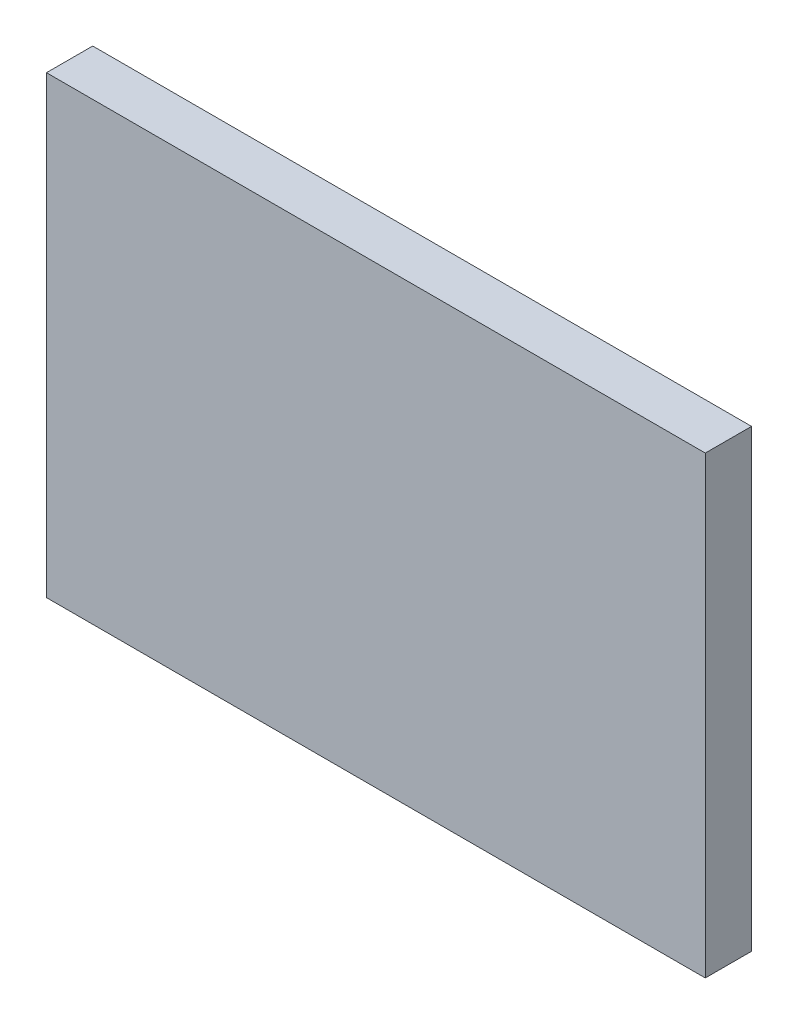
ISO-10303-21;
HEADER;
FILE_DESCRIPTION(('STEP AP214'),'2;1');
FILE_NAME('part.step','',(''),(''),'','','');
FILE_SCHEMA(('AUTOMOTIVE_DESIGN { 1 0 10303 214 1 1 1 1 }'));
ENDSEC;
DATA;
#1=APPLICATION_CONTEXT('core data for automotive mechanical design processes');
#2=APPLICATION_PROTOCOL_DEFINITION('international standard','automotive_design',2000,#1);
#3=PRODUCT_CONTEXT('',#1,'mechanical');
#4=PRODUCT('Part','Part','',(#3));
#5=PRODUCT_RELATED_PRODUCT_CATEGORY('part','',(#4));
#6=PRODUCT_DEFINITION_FORMATION('','',#4);
#7=PRODUCT_DEFINITION_CONTEXT('part definition',#1,'design');
#8=PRODUCT_DEFINITION('design','',#6,#7);
#9=PRODUCT_DEFINITION_SHAPE('','',#8);
#10=(LENGTH_UNIT() NAMED_UNIT(*) SI_UNIT(.MILLI.,.METRE.));
#11=(NAMED_UNIT(*) PLANE_ANGLE_UNIT() SI_UNIT($,.RADIAN.));
#12=(NAMED_UNIT(*) SI_UNIT($,.STERADIAN.) SOLID_ANGLE_UNIT());
#13=UNCERTAINTY_MEASURE_WITH_UNIT(LENGTH_MEASURE(1.E-05),#10,'distance_accuracy_value','');
#14=(GEOMETRIC_REPRESENTATION_CONTEXT(3) GLOBAL_UNCERTAINTY_ASSIGNED_CONTEXT((#13)) GLOBAL_UNIT_ASSIGNED_CONTEXT((#10,
#11,#12)) REPRESENTATION_CONTEXT('',''));
#15=CARTESIAN_POINT('',(0.,0.,0.));
#16=DIRECTION('',(0.,0.,1.));
#17=DIRECTION('',(1.,0.,0.));
#18=AXIS2_PLACEMENT_3D('',#15,#16,#17);
#19=CARTESIAN_POINT('',(-70.,40.,6.));
#20=DIRECTION('',(1.,0.,0.));
#21=DIRECTION('',(0.,1.,0.));
#22=AXIS2_PLACEMENT_3D('',#19,#20,#21);
#23=PLANE('',#22);
#24=DIRECTION('',(0.,-1.,0.));
#25=VECTOR('',#24,1.);
#26=CARTESIAN_POINT('',(-70.,40.,0.));
#27=LINE('',#26,#25);
#28=CARTESIAN_POINT('',(-70.,40.,0.));
#29=VERTEX_POINT('',#28);
#30=CARTESIAN_POINT('',(-70.,-19.,0.));
#31=VERTEX_POINT('',#30);
#32=EDGE_CURVE('E70',#29,#31,#27,.T.);
#33=ORIENTED_EDGE('',*,*,#32,.T.);
#34=DIRECTION('',(0.,0.,-1.));
#35=VECTOR('',#34,1.);
#36=CARTESIAN_POINT('',(-70.,-19.,6.));
#37=LINE('',#36,#35);
#38=CARTESIAN_POINT('',(-70.,-19.,6.));
#39=VERTEX_POINT('',#38);
#40=EDGE_CURVE('E11',#39,#31,#37,.T.);
#41=ORIENTED_EDGE('',*,*,#40,.F.);
#42=DIRECTION('',(0.,-1.,0.));
#43=VECTOR('',#42,1.);
#44=CARTESIAN_POINT('',(-70.,40.,6.));
#45=LINE('',#44,#43);
#46=CARTESIAN_POINT('',(-70.,40.,6.));
#47=VERTEX_POINT('',#46);
#48=EDGE_CURVE('E88',#47,#39,#45,.T.);
#49=ORIENTED_EDGE('',*,*,#48,.F.);
#50=DIRECTION('',(0.,0.,-1.));
#51=VECTOR('',#50,1.);
#52=CARTESIAN_POINT('',(-70.,40.,6.));
#53=LINE('',#52,#51);
#54=EDGE_CURVE('E82',#47,#29,#53,.T.);
#55=ORIENTED_EDGE('',*,*,#54,.T.);
#56=EDGE_LOOP('',(#33,#41,#49,#55));
#57=FACE_BOUND('',#56,.T.);
#58=ADVANCED_FACE('F26',(#57),#23,.F.);
#59=CARTESIAN_POINT('',(-70.,-19.,6.));
#60=DIRECTION('',(0.,1.,0.));
#61=DIRECTION('',(0.,0.,1.));
#62=AXIS2_PLACEMENT_3D('',#59,#60,#61);
#63=PLANE('',#62);
#64=DIRECTION('',(1.,0.,0.));
#65=VECTOR('',#64,1.);
#66=CARTESIAN_POINT('',(-70.,-19.,0.));
#67=LINE('',#66,#65);
#68=CARTESIAN_POINT('',(15.5,-19.,0.));
#69=VERTEX_POINT('',#68);
#70=EDGE_CURVE('E66',#31,#69,#67,.T.);
#71=ORIENTED_EDGE('',*,*,#70,.T.);
#72=DIRECTION('',(0.,0.,-1.));
#73=VECTOR('',#72,1.);
#74=CARTESIAN_POINT('',(15.5,-19.,6.));
#75=LINE('',#74,#73);
#76=CARTESIAN_POINT('',(15.5,-19.,6.));
#77=VERTEX_POINT('',#76);
#78=EDGE_CURVE('E33',#77,#69,#75,.T.);
#79=ORIENTED_EDGE('',*,*,#78,.F.);
#80=DIRECTION('',(1.,0.,0.));
#81=VECTOR('',#80,1.);
#82=CARTESIAN_POINT('',(-70.,-19.,6.));
#83=LINE('',#82,#81);
#84=EDGE_CURVE('E78',#39,#77,#83,.T.);
#85=ORIENTED_EDGE('',*,*,#84,.F.);
#86=ORIENTED_EDGE('',*,*,#40,.T.);
#87=EDGE_LOOP('',(#71,#79,#85,#86));
#88=FACE_BOUND('',#87,.T.);
#89=ADVANCED_FACE('F77',(#88),#63,.F.);
#90=CARTESIAN_POINT('',(15.5,40.,6.));
#91=DIRECTION('',(-1.,0.,0.));
#92=DIRECTION('',(0.,-1.,0.));
#93=AXIS2_PLACEMENT_3D('',#90,#91,#92);
#94=PLANE('',#93);
#95=DIRECTION('',(0.,1.,0.));
#96=VECTOR('',#95,1.);
#97=CARTESIAN_POINT('',(15.5,40.,0.));
#98=LINE('',#97,#96);
#99=CARTESIAN_POINT('',(15.5,40.,0.));
#100=VERTEX_POINT('',#99);
#101=EDGE_CURVE('E71',#69,#100,#98,.T.);
#102=ORIENTED_EDGE('',*,*,#101,.T.);
#103=DIRECTION('',(0.,0.,-1.));
#104=VECTOR('',#103,1.);
#105=CARTESIAN_POINT('',(15.5,40.,6.));
#106=LINE('',#105,#104);
#107=CARTESIAN_POINT('',(15.5,40.,6.));
#108=VERTEX_POINT('',#107);
#109=EDGE_CURVE('E94',#108,#100,#106,.T.);
#110=ORIENTED_EDGE('',*,*,#109,.F.);
#111=DIRECTION('',(0.,1.,0.));
#112=VECTOR('',#111,1.);
#113=CARTESIAN_POINT('',(15.5,40.,6.));
#114=LINE('',#113,#112);
#115=EDGE_CURVE('E45',#77,#108,#114,.T.);
#116=ORIENTED_EDGE('',*,*,#115,.F.);
#117=ORIENTED_EDGE('',*,*,#78,.T.);
#118=EDGE_LOOP('',(#102,#110,#116,#117));
#119=FACE_BOUND('',#118,.T.);
#120=ADVANCED_FACE('F97',(#119),#94,.F.);
#121=CARTESIAN_POINT('',(-70.,40.,6.));
#122=DIRECTION('',(0.,-1.,0.));
#123=DIRECTION('',(0.,0.,-1.));
#124=AXIS2_PLACEMENT_3D('',#121,#122,#123);
#125=PLANE('',#124);
#126=DIRECTION('',(-1.,0.,0.));
#127=VECTOR('',#126,1.);
#128=CARTESIAN_POINT('',(-70.,40.,0.));
#129=LINE('',#128,#127);
#130=EDGE_CURVE('E86',#100,#29,#129,.T.);
#131=ORIENTED_EDGE('',*,*,#130,.T.);
#132=ORIENTED_EDGE('',*,*,#54,.F.);
#133=DIRECTION('',(-1.,0.,0.));
#134=VECTOR('',#133,1.);
#135=CARTESIAN_POINT('',(-70.,40.,6.));
#136=LINE('',#135,#134);
#137=EDGE_CURVE('E40',#108,#47,#136,.T.);
#138=ORIENTED_EDGE('',*,*,#137,.F.);
#139=ORIENTED_EDGE('',*,*,#109,.T.);
#140=EDGE_LOOP('',(#131,#132,#138,#139));
#141=FACE_BOUND('',#140,.T.);
#142=ADVANCED_FACE('F99',(#141),#125,.F.);
#143=CARTESIAN_POINT('',(-70.,-19.,6.));
#144=DIRECTION('',(0.,0.,1.));
#145=DIRECTION('',(1.,0.,0.));
#146=AXIS2_PLACEMENT_3D('',#143,#144,#145);
#147=PLANE('',#146);
#148=ORIENTED_EDGE('',*,*,#48,.T.);
#149=ORIENTED_EDGE('',*,*,#84,.T.);
#150=ORIENTED_EDGE('',*,*,#115,.T.);
#151=ORIENTED_EDGE('',*,*,#137,.T.);
#152=EDGE_LOOP('',(#148,#149,#150,#151));
#153=FACE_BOUND('',#152,.T.);
#154=ADVANCED_FACE('F100',(#153),#147,.T.);
#155=CARTESIAN_POINT('',(-70.,-19.,0.));
#156=DIRECTION('',(0.,0.,1.));
#157=DIRECTION('',(1.,0.,0.));
#158=AXIS2_PLACEMENT_3D('',#155,#156,#157);
#159=PLANE('',#158);
#160=ORIENTED_EDGE('',*,*,#32,.F.);
#161=ORIENTED_EDGE('',*,*,#130,.F.);
#162=ORIENTED_EDGE('',*,*,#101,.F.);
#163=ORIENTED_EDGE('',*,*,#70,.F.);
#164=EDGE_LOOP('',(#160,#161,#162,#163));
#165=FACE_BOUND('',#164,.T.);
#166=ADVANCED_FACE('F67',(#165),#159,.F.);
#167=CLOSED_SHELL('',(#58,#89,#120,#142,#154,#166));
#168=MANIFOLD_SOLID_BREP('B2',#167);
#169=ADVANCED_BREP_SHAPE_REPRESENTATION('',(#18,#168),#14);
#170=SHAPE_DEFINITION_REPRESENTATION(#9,#169);
ENDSEC;
END-ISO-10303-21;
